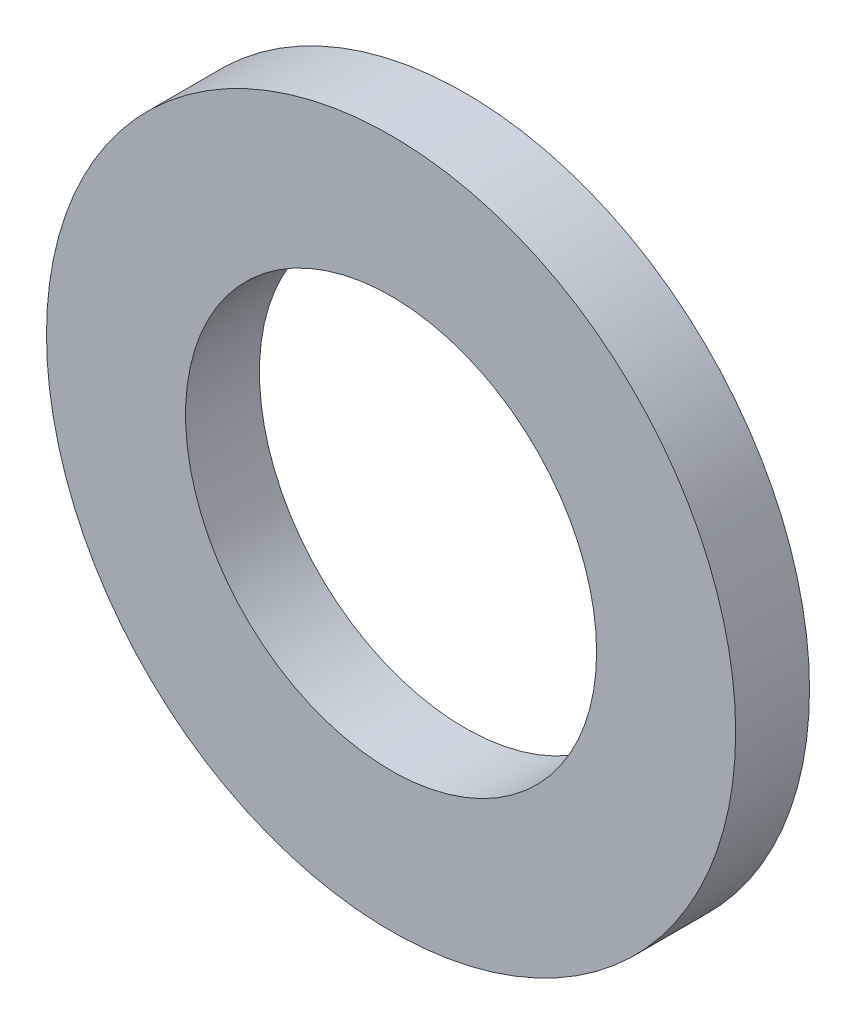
ISO-10303-21;
HEADER;
FILE_DESCRIPTION(('STEP AP214'),'2;1');
FILE_NAME('part.step','',(''),(''),'','','');
FILE_SCHEMA(('AUTOMOTIVE_DESIGN { 1 0 10303 214 1 1 1 1 }'));
ENDSEC;
DATA;
#1=APPLICATION_CONTEXT('core data for automotive mechanical design processes');
#2=APPLICATION_PROTOCOL_DEFINITION('international standard','automotive_design',2000,#1);
#3=PRODUCT_CONTEXT('',#1,'mechanical');
#4=PRODUCT('Part','Part','',(#3));
#5=PRODUCT_RELATED_PRODUCT_CATEGORY('part','',(#4));
#6=PRODUCT_DEFINITION_FORMATION('','',#4);
#7=PRODUCT_DEFINITION_CONTEXT('part definition',#1,'design');
#8=PRODUCT_DEFINITION('design','',#6,#7);
#9=PRODUCT_DEFINITION_SHAPE('','',#8);
#10=(LENGTH_UNIT() NAMED_UNIT(*) SI_UNIT(.MILLI.,.METRE.));
#11=(NAMED_UNIT(*) PLANE_ANGLE_UNIT() SI_UNIT($,.RADIAN.));
#12=(NAMED_UNIT(*) SI_UNIT($,.STERADIAN.) SOLID_ANGLE_UNIT());
#13=UNCERTAINTY_MEASURE_WITH_UNIT(LENGTH_MEASURE(1.E-05),#10,'distance_accuracy_value','');
#14=(GEOMETRIC_REPRESENTATION_CONTEXT(3) GLOBAL_UNCERTAINTY_ASSIGNED_CONTEXT((#13)) GLOBAL_UNIT_ASSIGNED_CONTEXT((#10,
#11,#12)) REPRESENTATION_CONTEXT('',''));
#15=CARTESIAN_POINT('',(0.,0.,0.));
#16=DIRECTION('',(0.,0.,1.));
#17=DIRECTION('',(1.,0.,0.));
#18=AXIS2_PLACEMENT_3D('',#15,#16,#17);
#19=CARTESIAN_POINT('',(0.,0.,3.));
#20=DIRECTION('',(0.,0.,1.));
#21=DIRECTION('',(1.,0.,0.));
#22=AXIS2_PLACEMENT_3D('',#19,#20,#21);
#23=PLANE('',#22);
#24=CARTESIAN_POINT('',(0.,0.,3.));
#25=DIRECTION('',(0.,0.,1.));
#26=DIRECTION('',(1.,0.,0.));
#27=AXIS2_PLACEMENT_3D('',#24,#25,#26);
#28=CIRCLE('',#27,14.);
#29=CARTESIAN_POINT('',(14.,0.,3.));
#30=VERTEX_POINT('',#29);
#31=EDGE_CURVE('E10',#30,#30,#28,.T.);
#32=ORIENTED_EDGE('',*,*,#31,.T.);
#33=EDGE_LOOP('',(#32));
#34=FACE_BOUND('',#33,.T.);
#35=CARTESIAN_POINT('',(0.,0.,3.));
#36=DIRECTION('',(0.,0.,1.));
#37=DIRECTION('',(1.,0.,0.));
#38=AXIS2_PLACEMENT_3D('',#35,#36,#37);
#39=CIRCLE('',#38,8.35);
#40=CARTESIAN_POINT('',(8.35,0.,3.));
#41=VERTEX_POINT('',#40);
#42=EDGE_CURVE('E40',#41,#41,#39,.T.);
#43=ORIENTED_EDGE('',*,*,#42,.F.);
#44=EDGE_LOOP('',(#43));
#45=FACE_BOUND('',#44,.T.);
#46=ADVANCED_FACE('F29',(#34,#45),#23,.T.);
#47=CARTESIAN_POINT('',(0.,0.,0.));
#48=DIRECTION('',(0.,0.,1.));
#49=DIRECTION('',(1.,0.,0.));
#50=AXIS2_PLACEMENT_3D('',#47,#48,#49);
#51=PLANE('',#50);
#52=CARTESIAN_POINT('',(0.,0.,0.));
#53=DIRECTION('',(0.,0.,1.));
#54=DIRECTION('',(1.,0.,0.));
#55=AXIS2_PLACEMENT_3D('',#52,#53,#54);
#56=CIRCLE('',#55,14.);
#57=CARTESIAN_POINT('',(14.,0.,0.));
#58=VERTEX_POINT('',#57);
#59=EDGE_CURVE('E33',#58,#58,#56,.T.);
#60=ORIENTED_EDGE('',*,*,#59,.F.);
#61=EDGE_LOOP('',(#60));
#62=FACE_BOUND('',#61,.T.);
#63=CARTESIAN_POINT('',(0.,0.,0.));
#64=DIRECTION('',(0.,0.,1.));
#65=DIRECTION('',(1.,0.,0.));
#66=AXIS2_PLACEMENT_3D('',#63,#64,#65);
#67=CIRCLE('',#66,8.35);
#68=CARTESIAN_POINT('',(8.35,0.,0.));
#69=VERTEX_POINT('',#68);
#70=EDGE_CURVE('E42',#69,#69,#67,.T.);
#71=ORIENTED_EDGE('',*,*,#70,.T.);
#72=EDGE_LOOP('',(#71));
#73=FACE_BOUND('',#72,.T.);
#74=ADVANCED_FACE('F52',(#62,#73),#51,.F.);
#75=CARTESIAN_POINT('',(0.,0.,3.));
#76=DIRECTION('',(0.,0.,-1.));
#77=DIRECTION('',(-1.,0.,0.));
#78=AXIS2_PLACEMENT_3D('',#75,#76,#77);
#79=CYLINDRICAL_SURFACE('',#78,14.);
#80=ORIENTED_EDGE('',*,*,#31,.F.);
#81=EDGE_LOOP('',(#80));
#82=FACE_BOUND('',#81,.T.);
#83=ORIENTED_EDGE('',*,*,#59,.T.);
#84=EDGE_LOOP('',(#83));
#85=FACE_BOUND('',#84,.T.);
#86=ADVANCED_FACE('F31',(#82,#85),#79,.T.);
#87=CARTESIAN_POINT('',(0.,0.,3.));
#88=DIRECTION('',(0.,0.,-1.));
#89=DIRECTION('',(-1.,0.,0.));
#90=AXIS2_PLACEMENT_3D('',#87,#88,#89);
#91=CYLINDRICAL_SURFACE('',#90,8.35);
#92=ORIENTED_EDGE('',*,*,#42,.T.);
#93=EDGE_LOOP('',(#92));
#94=FACE_BOUND('',#93,.T.);
#95=ORIENTED_EDGE('',*,*,#70,.F.);
#96=EDGE_LOOP('',(#95));
#97=FACE_BOUND('',#96,.T.);
#98=ADVANCED_FACE('F48',(#94,#97),#91,.F.);
#99=CLOSED_SHELL('',(#46,#74,#86,#98));
#100=MANIFOLD_SOLID_BREP('B2',#99);
#101=ADVANCED_BREP_SHAPE_REPRESENTATION('',(#18,#100),#14);
#102=SHAPE_DEFINITION_REPRESENTATION(#9,#101);
ENDSEC;
END-ISO-10303-21;
